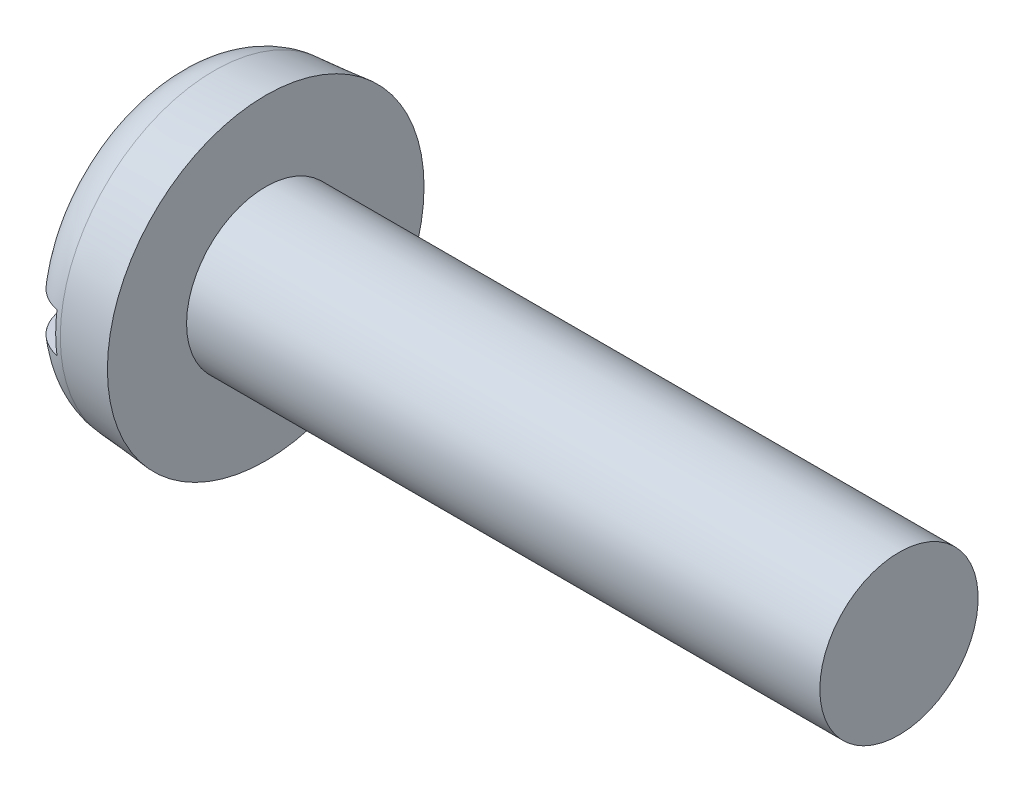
ISO-10303-21;
HEADER;
FILE_DESCRIPTION(('STEP AP214'),'2;1');
FILE_NAME('part.step','',(''),(''),'','','');
FILE_SCHEMA(('AUTOMOTIVE_DESIGN { 1 0 10303 214 1 1 1 1 }'));
ENDSEC;
DATA;
#1=APPLICATION_CONTEXT('core data for automotive mechanical design processes');
#2=APPLICATION_PROTOCOL_DEFINITION('international standard','automotive_design',2000,#1);
#3=PRODUCT_CONTEXT('',#1,'mechanical');
#4=PRODUCT('Part','Part','',(#3));
#5=PRODUCT_RELATED_PRODUCT_CATEGORY('part','',(#4));
#6=PRODUCT_DEFINITION_FORMATION('','',#4);
#7=PRODUCT_DEFINITION_CONTEXT('part definition',#1,'design');
#8=PRODUCT_DEFINITION('design','',#6,#7);
#9=PRODUCT_DEFINITION_SHAPE('','',#8);
#10=(LENGTH_UNIT() NAMED_UNIT(*) SI_UNIT(.MILLI.,.METRE.));
#11=(NAMED_UNIT(*) PLANE_ANGLE_UNIT() SI_UNIT($,.RADIAN.));
#12=(NAMED_UNIT(*) SI_UNIT($,.STERADIAN.) SOLID_ANGLE_UNIT());
#13=UNCERTAINTY_MEASURE_WITH_UNIT(LENGTH_MEASURE(1.E-05),#10,'distance_accuracy_value','');
#14=(GEOMETRIC_REPRESENTATION_CONTEXT(3) GLOBAL_UNCERTAINTY_ASSIGNED_CONTEXT((#13)) GLOBAL_UNIT_ASSIGNED_CONTEXT((#10,
#11,#12)) REPRESENTATION_CONTEXT('',''));
#15=CARTESIAN_POINT('',(0.,0.,0.));
#16=DIRECTION('',(0.,0.,1.));
#17=DIRECTION('',(1.,0.,0.));
#18=AXIS2_PLACEMENT_3D('',#15,#16,#17);
#19=CARTESIAN_POINT('',(0.,0.,0.));
#20=DIRECTION('',(-1.,0.,0.));
#21=DIRECTION('',(0.,0.,1.));
#22=AXIS2_PLACEMENT_3D('',#19,#20,#21);
#23=PLANE('',#22);
#24=DIRECTION('',(0.,0.,-1.));
#25=VECTOR('',#24,1.);
#26=CARTESIAN_POINT('',(0.,1.25,10.));
#27=LINE('',#26,#25);
#28=CARTESIAN_POINT('',(0.,1.25,6.60890143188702));
#29=VERTEX_POINT('',#28);
#30=CARTESIAN_POINT('',(0.,1.25,-6.60890143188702));
#31=VERTEX_POINT('',#30);
#32=EDGE_CURVE('E90',#29,#31,#27,.T.);
#33=ORIENTED_EDGE('',*,*,#32,.F.);
#34=CARTESIAN_POINT('',(0.,0.,0.));
#35=DIRECTION('',(-1.,0.,0.));
#36=DIRECTION('',(0.,0.,1.));
#37=AXIS2_PLACEMENT_3D('',#34,#35,#36);
#38=CIRCLE('',#37,6.72607449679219);
#39=EDGE_CURVE('E96',#29,#31,#38,.T.);
#40=ORIENTED_EDGE('',*,*,#39,.T.);
#41=EDGE_LOOP('',(#33,#40));
#42=FACE_BOUND('',#41,.T.);
#43=ADVANCED_FACE('F37',(#42),#23,.T.);
#44=CARTESIAN_POINT('',(-25.4,0.,0.));
#45=DIRECTION('',(-1.,0.,0.));
#46=DIRECTION('',(0.,0.,1.));
#47=AXIS2_PLACEMENT_3D('',#44,#45,#46);
#48=CYLINDRICAL_SURFACE('',#47,5.);
#49=CARTESIAN_POINT('',(46.,0.,0.));
#50=DIRECTION('',(-1.,0.,0.));
#51=DIRECTION('',(0.,0.,1.));
#52=AXIS2_PLACEMENT_3D('',#49,#50,#51);
#53=CIRCLE('',#52,5.);
#54=CARTESIAN_POINT('',(46.,0.,5.));
#55=VERTEX_POINT('',#54);
#56=EDGE_CURVE('E153',#55,#55,#53,.T.);
#57=ORIENTED_EDGE('',*,*,#56,.T.);
#58=EDGE_LOOP('',(#57));
#59=FACE_BOUND('',#58,.T.);
#60=CARTESIAN_POINT('',(6.,0.,0.));
#61=DIRECTION('',(-1.,0.,0.));
#62=DIRECTION('',(0.,0.,1.));
#63=AXIS2_PLACEMENT_3D('',#60,#61,#62);
#64=CIRCLE('',#63,5.);
#65=CARTESIAN_POINT('',(6.,0.,5.));
#66=VERTEX_POINT('',#65);
#67=EDGE_CURVE('E97',#66,#66,#64,.T.);
#68=ORIENTED_EDGE('',*,*,#67,.F.);
#69=EDGE_LOOP('',(#68));
#70=FACE_BOUND('',#69,.T.);
#71=ADVANCED_FACE('F142',(#59,#70),#48,.T.);
#72=CARTESIAN_POINT('',(6.,5.,0.));
#73=DIRECTION('',(-1.,0.,0.));
#74=DIRECTION('',(0.,0.,1.));
#75=AXIS2_PLACEMENT_3D('',#72,#73,#74);
#76=PLANE('',#75);
#77=CARTESIAN_POINT('',(6.,0.,0.));
#78=DIRECTION('',(-1.,0.,0.));
#79=DIRECTION('',(0.,0.,1.));
#80=AXIS2_PLACEMENT_3D('',#77,#78,#79);
#81=CIRCLE('',#80,10.);
#82=CARTESIAN_POINT('',(6.,0.,10.));
#83=VERTEX_POINT('',#82);
#84=EDGE_CURVE('E102',#83,#83,#81,.T.);
#85=ORIENTED_EDGE('',*,*,#84,.F.);
#86=EDGE_LOOP('',(#85));
#87=FACE_BOUND('',#86,.T.);
#88=ORIENTED_EDGE('',*,*,#67,.T.);
#89=EDGE_LOOP('',(#88));
#90=FACE_BOUND('',#89,.T.);
#91=ADVANCED_FACE('F139',(#87,#90),#76,.F.);
#92=CARTESIAN_POINT('',(0.,0.,0.));
#93=DIRECTION('',(1.,0.,0.));
#94=DIRECTION('',(0.,0.,-1.));
#95=AXIS2_PLACEMENT_3D('',#92,#93,#94);
#96=CONICAL_SURFACE('',#95,9.47506801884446,0.0872664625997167);
#97=CARTESIAN_POINT('',(2.73853277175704,0.,0.));
#98=DIRECTION('',(-1.,0.,0.));
#99=DIRECTION('',(0.,0.,1.));
#100=AXIS2_PLACEMENT_3D('',#97,#98,#99);
#101=CIRCLE('',#100,9.71465859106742);
#102=CARTESIAN_POINT('',(2.73853277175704,0.,9.71465859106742));
#103=VERTEX_POINT('',#102);
#104=EDGE_CURVE('E100',#103,#103,#101,.F.);
#105=ORIENTED_EDGE('',*,*,#104,.T.);
#106=EDGE_LOOP('',(#105));
#107=FACE_BOUND('',#106,.T.);
#108=ORIENTED_EDGE('',*,*,#84,.T.);
#109=EDGE_LOOP('',(#108));
#110=FACE_BOUND('',#109,.T.);
#111=ADVANCED_FACE('F136',(#107,#110),#96,.T.);
#112=DIRECTION('',(0.,0.,1.));
#113=VECTOR('',#112,1.);
#114=CARTESIAN_POINT('',(0.,-1.25,-10.));
#115=LINE('',#114,#113);
#116=CARTESIAN_POINT('',(0.,-1.25,-6.60890143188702));
#117=VERTEX_POINT('',#116);
#118=CARTESIAN_POINT('',(0.,-1.25,6.60890143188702));
#119=VERTEX_POINT('',#118);
#120=EDGE_CURVE('E81',#117,#119,#115,.T.);
#121=ORIENTED_EDGE('',*,*,#120,.F.);
#122=EDGE_CURVE('E88',#117,#119,#38,.T.);
#123=ORIENTED_EDGE('',*,*,#122,.T.);
#124=EDGE_LOOP('',(#121,#123));
#125=FACE_BOUND('',#124,.T.);
#126=ADVANCED_FACE('F87',(#125),#23,.T.);
#127=CARTESIAN_POINT('',(46.,5.,0.));
#128=DIRECTION('',(1.,0.,0.));
#129=DIRECTION('',(0.,0.,-1.));
#130=AXIS2_PLACEMENT_3D('',#127,#128,#129);
#131=PLANE('',#130);
#132=ORIENTED_EDGE('',*,*,#56,.F.);
#133=EDGE_LOOP('',(#132));
#134=FACE_BOUND('',#133,.T.);
#135=ADVANCED_FACE('F129',(#134),#131,.T.);
#136=CARTESIAN_POINT('',(3.,0.,0.));
#137=DIRECTION('',(-1.,0.,0.));
#138=DIRECTION('',(0.,0.,1.));
#139=AXIS2_PLACEMENT_3D('',#136,#137,#138);
#140=TOROIDAL_SURFACE('',#139,6.72607449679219,3.);
#141=CARTESIAN_POINT('',(0.913950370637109,1.25,-8.79369083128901));
#142=CARTESIAN_POINT('',(1.03407751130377,1.25,-8.91107806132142));
#143=CARTESIAN_POINT('',(1.16414710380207,1.25,-9.0184570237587));
#144=CARTESIAN_POINT('',(1.44055548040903,1.25,-9.20996884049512));
#145=CARTESIAN_POINT('',(1.58691212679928,1.25,-9.29407581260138));
#146=CARTESIAN_POINT('',(1.89167269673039,1.25,-9.43645928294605));
#147=CARTESIAN_POINT('',(2.0500739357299,1.25,-9.49474151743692));
#148=CARTESIAN_POINT('',(2.37439631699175,1.25,-9.58375548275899));
#149=CARTESIAN_POINT('',(2.54031567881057,1.25,-9.61449370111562));
#150=CARTESIAN_POINT('',(2.87435662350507,1.25,-9.64747712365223));
#151=CARTESIAN_POINT('',(3.04246808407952,1.25,-9.64982487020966));
#152=CARTESIAN_POINT('',(3.37669612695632,1.25,-9.62622242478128));
#153=CARTESIAN_POINT('',(3.54281266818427,1.25,-9.60027165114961));
#154=CARTESIAN_POINT('',(3.8681098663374,1.25,-9.52088746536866));
#155=CARTESIAN_POINT('',(4.02729932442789,1.25,-9.46749010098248));
#156=CARTESIAN_POINT('',(4.33448631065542,1.25,-9.33479520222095));
#157=CARTESIAN_POINT('',(4.48248380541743,1.25,-9.25549759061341));
#158=CARTESIAN_POINT('',(4.76352766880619,1.25,-9.07306642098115));
#159=CARTESIAN_POINT('',(4.89653363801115,1.25,-8.96987064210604));
#160=CARTESIAN_POINT('',(5.14347241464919,1.25,-8.74274923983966));
#161=CARTESIAN_POINT('',(5.25740480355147,1.25,-8.61882316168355));
#162=CARTESIAN_POINT('',(5.46381187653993,1.25,-8.35290133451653));
#163=CARTESIAN_POINT('',(5.5561381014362,1.25,-8.21079038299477));
#164=CARTESIAN_POINT('',(5.71591382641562,1.25,-7.91321813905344));
#165=CARTESIAN_POINT('',(5.78336219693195,1.25,-7.75775624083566));
#166=CARTESIAN_POINT('',(5.89229296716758,1.25,-7.43609765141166));
#167=CARTESIAN_POINT('',(5.93348408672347,1.25,-7.26980235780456));
#168=CARTESIAN_POINT('',(5.98780094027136,1.25,-6.93269546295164));
#169=CARTESIAN_POINT('',(6.00092472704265,1.25,-6.76188354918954));
#170=CARTESIAN_POINT('',(5.99895954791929,1.25,-6.41790932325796));
#171=CARTESIAN_POINT('',(5.98345242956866,1.25,-6.24474942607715));
#172=CARTESIAN_POINT('',(5.9240547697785,1.25,-5.90336911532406));
#173=CARTESIAN_POINT('',(5.88016160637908,1.25,-5.73514915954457));
#174=CARTESIAN_POINT('',(5.76444528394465,1.25,-5.40563318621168));
#175=CARTESIAN_POINT('',(5.69219500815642,1.25,-5.24448707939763));
#176=CARTESIAN_POINT('',(5.52187152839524,1.25,-4.93645275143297));
#177=CARTESIAN_POINT('',(5.42379531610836,1.25,-4.78956619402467));
#178=CARTESIAN_POINT('',(5.20362037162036,1.25,-4.51322087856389));
#179=CARTESIAN_POINT('',(5.08134720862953,1.25,-4.38390089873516));
#180=CARTESIAN_POINT('',(4.81646755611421,1.25,-4.14804563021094));
#181=CARTESIAN_POINT('',(4.67386150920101,1.25,-4.04150984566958));
#182=CARTESIAN_POINT('',(4.37493583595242,1.25,-3.85675206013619));
#183=CARTESIAN_POINT('',(4.21891607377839,1.25,-3.7780461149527));
#184=CARTESIAN_POINT('',(3.89540554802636,1.25,-3.64953247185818));
#185=CARTESIAN_POINT('',(3.72792001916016,1.25,-3.59971168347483));
#186=CARTESIAN_POINT('',(3.39522326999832,1.25,-3.53305783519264));
#187=CARTESIAN_POINT('',(3.23031745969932,1.25,-3.51469914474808));
#188=CARTESIAN_POINT('',(2.89985413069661,1.25,-3.50709369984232));
#189=CARTESIAN_POINT('',(2.73429676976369,1.25,-3.51784028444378));
#190=CARTESIAN_POINT('',(2.41348778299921,1.25,-3.56699036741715));
#191=CARTESIAN_POINT('',(2.25807967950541,1.25,-3.60438488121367));
#192=CARTESIAN_POINT('',(1.95549755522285,1.25,-3.70411822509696));
#193=CARTESIAN_POINT('',(1.80832473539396,1.25,-3.76646068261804));
#194=CARTESIAN_POINT('',(1.52239485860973,1.25,-3.91558892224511));
#195=CARTESIAN_POINT('',(1.38392868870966,1.25,-4.00293114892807));
#196=CARTESIAN_POINT('',(1.12266061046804,1.25,-4.19852761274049));
#197=CARTESIAN_POINT('',(0.999862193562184,1.25,-4.30678649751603));
#198=CARTESIAN_POINT('',(0.766801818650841,1.25,-4.54725082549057));
#199=CARTESIAN_POINT('',(0.657519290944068,1.25,-4.68040649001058));
#200=CARTESIAN_POINT('',(0.462072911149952,1.25,-4.96272965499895));
#201=CARTESIAN_POINT('',(0.375912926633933,1.25,-5.11189982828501));
#202=CARTESIAN_POINT('',(0.226781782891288,1.25,-5.42688300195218));
#203=CARTESIAN_POINT('',(0.164574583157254,1.25,-5.59305850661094));
#204=CARTESIAN_POINT('',(0.0689385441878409,1.25,-5.93349549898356));
#205=CARTESIAN_POINT('',(0.0355092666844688,1.25,-6.10775686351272));
#206=CARTESIAN_POINT('',(-0.00141343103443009,1.25,-6.45940175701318));
#207=CARTESIAN_POINT('',(-0.00491262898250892,1.25,-6.636784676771));
#208=CARTESIAN_POINT('',(0.0183732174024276,1.25,-6.98960681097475));
#209=CARTESIAN_POINT('',(0.0451639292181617,1.25,-7.16504565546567));
#210=CARTESIAN_POINT('',(0.127908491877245,1.25,-7.50633395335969));
#211=CARTESIAN_POINT('',(0.183455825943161,1.25,-7.67228216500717));
#212=CARTESIAN_POINT('',(0.322041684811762,1.25,-7.99211018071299));
#213=CARTESIAN_POINT('',(0.405044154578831,1.25,-8.14600548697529));
#214=CARTESIAN_POINT('',(0.560173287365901,1.25,-8.38236701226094));
#215=CARTESIAN_POINT('',(0.624662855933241,1.25,-8.4699404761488));
#216=CARTESIAN_POINT('',(0.76269837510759,1.25,-8.63763545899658));
#217=CARTESIAN_POINT('',(0.836244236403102,1.25,-8.71775705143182));
#218=CARTESIAN_POINT('',(0.913950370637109,1.25,-8.79369083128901));
#219=B_SPLINE_CURVE_WITH_KNOTS('',3,(#141,#142,#143,#144,#145,#146,#147,#148,#149,#150,#151,
#152,#153,#154,#155,#156,#157,#158,#159,#160,#161,#162,#163,#164,#165,#166,#167,#168,#169,#170,
#171,#172,#173,#174,#175,#176,#177,#178,#179,#180,#181,#182,#183,#184,#185,#186,#187,#188,#189,
#190,#191,#192,#193,#194,#195,#196,#197,#198,#199,#200,#201,#202,#203,#204,#205,#206,#207,#208,
#209,#210,#211,#212,#213,#214,#215,#216,#217,#218),.UNSPECIFIED.,.T.,.F.,(4,2,2,2,2,2,2,2,2,2,2,
2,2,2,2,2,2,2,2,2,2,2,2,2,2,2,2,2,2,2,2,2,2,2,2,2,2,2,4),(0.,0.503484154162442,1.00752603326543,
1.51145589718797,2.01526703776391,2.51725793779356,3.01925915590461,3.52060273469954,
4.02194780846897,4.52461314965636,5.02728951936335,5.53332459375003,6.0393826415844,
6.55096110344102,7.0625750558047,7.58172027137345,8.10091344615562,8.62824690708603,
9.15564182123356,9.68698702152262,10.2183206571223,10.7398986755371,11.2612401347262,
11.7564997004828,12.2516459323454,12.7289772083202,13.2063779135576,13.6953635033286,
14.1844578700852,14.6988978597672,15.2134238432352,15.7432176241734,16.2730033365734,
16.8026867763,17.3324693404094,17.854959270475,18.3767657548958,18.7024556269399,
19.0281422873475),.UNSPECIFIED.);
#220=CARTESIAN_POINT('',(2.4,1.25,-9.58429232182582));
#221=VERTEX_POINT('',#220);
#222=EDGE_CURVE('E11',#31,#221,#219,.T.);
#223=ORIENTED_EDGE('',*,*,#222,.F.);
#224=ORIENTED_EDGE('',*,*,#39,.F.);
#225=CARTESIAN_POINT('',(1.42400410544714,1.25,3.98178611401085));
#226=CARTESIAN_POINT('',(1.5612667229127,1.25,3.89297012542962));
#227=CARTESIAN_POINT('',(1.70580035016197,1.25,3.81523437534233));
#228=CARTESIAN_POINT('',(2.00584163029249,1.25,3.68474127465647));
#229=CARTESIAN_POINT('',(2.16135542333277,1.25,3.63199802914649));
#230=CARTESIAN_POINT('',(2.47937427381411,1.25,3.55367301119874));
#231=CARTESIAN_POINT('',(2.64188954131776,1.25,3.52813240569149));
#232=CARTESIAN_POINT('',(2.96885435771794,1.25,3.50557748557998));
#233=CARTESIAN_POINT('',(3.13330332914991,1.25,3.50855486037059));
#234=CARTESIAN_POINT('',(3.45489323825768,1.25,3.54240853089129));
#235=CARTESIAN_POINT('',(3.61211260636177,1.25,3.57254854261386));
#236=CARTESIAN_POINT('',(3.91940624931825,1.25,3.65837971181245));
#237=CARTESIAN_POINT('',(4.06947936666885,1.25,3.71407499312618));
#238=CARTESIAN_POINT('',(4.36105131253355,1.25,3.84997531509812));
#239=CARTESIAN_POINT('',(4.50236952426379,1.25,3.93056672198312));
#240=CARTESIAN_POINT('',(4.77037282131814,1.25,4.1132046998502));
#241=CARTESIAN_POINT('',(4.89705478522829,1.25,4.21525583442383));
#242=CARTESIAN_POINT('',(5.13904911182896,1.25,4.44362846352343));
#243=CARTESIAN_POINT('',(5.25343578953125,1.25,4.57093155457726));
#244=CARTESIAN_POINT('',(5.46008362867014,1.25,4.84238649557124));
#245=CARTESIAN_POINT('',(5.55234077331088,1.25,4.98654139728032));
#246=CARTESIAN_POINT('',(5.71512091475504,1.25,5.29301673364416));
#247=CARTESIAN_POINT('',(5.78479444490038,1.25,5.45578930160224));
#248=CARTESIAN_POINT('',(5.89593523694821,1.25,5.79070335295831));
#249=CARTESIAN_POINT('',(5.93740130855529,1.25,5.96284523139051));
#250=CARTESIAN_POINT('',(5.99085637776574,1.25,6.31223598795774));
#251=CARTESIAN_POINT('',(6.00274901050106,1.25,6.48949966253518));
#252=CARTESIAN_POINT('',(5.99618345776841,1.25,6.84347053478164));
#253=CARTESIAN_POINT('',(5.97772699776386,1.25,7.02017776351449));
#254=CARTESIAN_POINT('',(5.91120016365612,1.25,7.3655056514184));
#255=CARTESIAN_POINT('',(5.86352491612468,1.25,7.53420237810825));
#256=CARTESIAN_POINT('',(5.74006872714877,1.25,7.86098193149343));
#257=CARTESIAN_POINT('',(5.66429014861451,1.25,8.01906564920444));
#258=CARTESIAN_POINT('',(5.48810579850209,1.25,8.31744548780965));
#259=CARTESIAN_POINT('',(5.38811325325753,1.25,8.4579856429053));
#260=CARTESIAN_POINT('',(5.16566608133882,1.25,8.71999862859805));
#261=CARTESIAN_POINT('',(5.04321309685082,1.25,8.84147285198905));
#262=CARTESIAN_POINT('',(4.78105062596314,1.25,9.06026678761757));
#263=CARTESIAN_POINT('',(4.6415850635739,1.25,9.1578788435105));
#264=CARTESIAN_POINT('',(4.34813222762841,1.25,9.32806433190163));
#265=CARTESIAN_POINT('',(4.19414569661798,1.25,9.40063904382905));
#266=CARTESIAN_POINT('',(3.87745295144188,1.25,9.5180728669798));
#267=CARTESIAN_POINT('',(3.71483300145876,1.25,9.56316469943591));
#268=CARTESIAN_POINT('',(3.38431824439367,1.25,9.6252741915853));
#269=CARTESIAN_POINT('',(3.21642359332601,1.25,9.64229268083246));
#270=CARTESIAN_POINT('',(2.88090253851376,1.25,9.64774078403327));
#271=CARTESIAN_POINT('',(2.71327812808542,1.25,9.63629403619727));
#272=CARTESIAN_POINT('',(2.38233537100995,1.25,9.58540890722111));
#273=CARTESIAN_POINT('',(2.21901698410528,1.25,9.54597078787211));
#274=CARTESIAN_POINT('',(1.90136639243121,1.25,9.440278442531));
#275=CARTESIAN_POINT('',(1.74703114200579,1.25,9.37403336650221));
#276=CARTESIAN_POINT('',(1.45161989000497,1.25,9.21666160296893));
#277=CARTESIAN_POINT('',(1.31054399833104,1.25,9.12553470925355));
#278=CARTESIAN_POINT('',(1.04508569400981,1.25,8.92067026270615));
#279=CARTESIAN_POINT('',(0.920765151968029,1.25,8.80685255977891));
#280=CARTESIAN_POINT('',(0.69282275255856,1.25,8.56010291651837));
#281=CARTESIAN_POINT('',(0.58920150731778,1.25,8.42717041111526));
#282=CARTESIAN_POINT('',(0.404709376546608,1.25,8.14489607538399));
#283=CARTESIAN_POINT('',(0.324019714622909,1.25,7.99543583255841));
#284=CARTESIAN_POINT('',(0.188546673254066,1.25,7.68520850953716));
#285=CARTESIAN_POINT('',(0.133764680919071,1.25,7.52444082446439));
#286=CARTESIAN_POINT('',(0.0509263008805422,1.25,7.19412294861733));
#287=CARTESIAN_POINT('',(0.0231968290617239,1.25,7.02449081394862));
#288=CARTESIAN_POINT('',(-0.00385005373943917,1.25,6.68298800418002));
#289=CARTESIAN_POINT('',(-0.00316643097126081,1.25,6.51111724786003));
#290=CARTESIAN_POINT('',(0.02659266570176,1.25,6.16720755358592));
#291=CARTESIAN_POINT('',(0.0561017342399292,1.25,5.99520616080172));
#292=CARTESIAN_POINT('',(0.143149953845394,1.25,5.65840060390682));
#293=CARTESIAN_POINT('',(0.200698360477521,1.25,5.49359883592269));
#294=CARTESIAN_POINT('',(0.343213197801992,1.25,5.17328528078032));
#295=CARTESIAN_POINT('',(0.428585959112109,1.25,5.01795437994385));
#296=CARTESIAN_POINT('',(0.624063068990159,1.25,4.72386676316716));
#297=CARTESIAN_POINT('',(0.734143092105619,1.25,4.58509394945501));
#298=CARTESIAN_POINT('',(0.939954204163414,1.25,4.36648585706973));
#299=CARTESIAN_POINT('',(1.03018849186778,1.25,4.28140949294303));
#300=CARTESIAN_POINT('',(1.2202259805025,1.25,4.12269833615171));
#301=CARTESIAN_POINT('',(1.32002902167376,1.25,4.04906335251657));
#302=CARTESIAN_POINT('',(1.42400410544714,1.25,3.98178611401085));
#303=B_SPLINE_CURVE_WITH_KNOTS('',3,(#225,#226,#227,#228,#229,#230,#231,#232,#233,#234,#235,
#236,#237,#238,#239,#240,#241,#242,#243,#244,#245,#246,#247,#248,#249,#250,#251,#252,#253,#254,
#255,#256,#257,#258,#259,#260,#261,#262,#263,#264,#265,#266,#267,#268,#269,#270,#271,#272,#273,
#274,#275,#276,#277,#278,#279,#280,#281,#282,#283,#284,#285,#286,#287,#288,#289,#290,#291,#292,
#293,#294,#295,#296,#297,#298,#299,#300,#301,#302),.UNSPECIFIED.,.T.,.F.,(4,2,2,2,2,2,2,2,2,2,2,
2,2,2,2,2,2,2,2,2,2,2,2,2,2,2,2,2,2,2,2,2,2,2,2,2,2,2,4),(0.,0.490052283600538,
0.980380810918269,1.47145032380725,1.96237673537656,2.44038333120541,2.91846708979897,
3.40437848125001,3.89039331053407,4.40152059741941,4.91274059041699,5.44141242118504,
5.97010655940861,6.50052119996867,7.03090568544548,7.55427135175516,8.07759302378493,
8.59254557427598,9.10746048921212,9.61570935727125,10.1239322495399,10.6277895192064,
11.1316318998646,11.633289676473,12.1349427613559,12.6364247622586,13.1379109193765,
13.6412008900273,14.1445057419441,14.6516840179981,15.1588894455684,15.6721509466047,
16.1854311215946,16.7065528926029,17.2278467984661,17.7571227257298,18.2858798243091,
18.657095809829,19.0283055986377),.UNSPECIFIED.);
#304=CARTESIAN_POINT('',(2.4,1.25,9.58429232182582));
#305=VERTEX_POINT('',#304);
#306=EDGE_CURVE('E114',#305,#29,#303,.T.);
#307=ORIENTED_EDGE('',*,*,#306,.F.);
#308=CARTESIAN_POINT('',(2.4,0.,0.));
#309=DIRECTION('',(-1.,0.,0.));
#310=DIRECTION('',(0.,0.,1.));
#311=AXIS2_PLACEMENT_3D('',#308,#309,#310);
#312=CIRCLE('',#311,9.665462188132);
#313=CARTESIAN_POINT('',(2.4,-1.25,9.58429232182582));
#314=VERTEX_POINT('',#313);
#315=EDGE_CURVE('E108',#305,#314,#312,.F.);
#316=ORIENTED_EDGE('',*,*,#315,.T.);
#317=CARTESIAN_POINT('',(1.42400410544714,-1.25,3.98178611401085));
#318=CARTESIAN_POINT('',(1.27725127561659,-1.25,4.07675719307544));
#319=CARTESIAN_POINT('',(1.13859909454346,-1.25,4.18453932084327));
#320=CARTESIAN_POINT('',(0.881278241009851,-1.25,4.42203149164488));
#321=CARTESIAN_POINT('',(0.762645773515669,-1.25,4.55178043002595));
#322=CARTESIAN_POINT('',(0.548773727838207,-1.25,4.82899748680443));
#323=CARTESIAN_POINT('',(0.453498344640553,-1.25,4.97643796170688));
#324=CARTESIAN_POINT('',(0.288693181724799,-1.25,5.28498247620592));
#325=CARTESIAN_POINT('',(0.219153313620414,-1.25,5.44608113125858));
#326=CARTESIAN_POINT('',(0.106971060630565,-1.25,5.7798739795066));
#327=CARTESIAN_POINT('',(0.0647116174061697,-1.25,5.95269714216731));
#328=CARTESIAN_POINT('',(0.0100221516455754,-1.25,6.30302303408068));
#329=CARTESIAN_POINT('',(-0.00240602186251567,-1.25,6.48052605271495));
#330=CARTESIAN_POINT('',(0.00315593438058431,-1.25,6.83381450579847));
#331=CARTESIAN_POINT('',(0.0209325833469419,-1.25,7.00960323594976));
#332=CARTESIAN_POINT('',(0.0862335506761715,-1.25,7.35556997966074));
#333=CARTESIAN_POINT('',(0.133755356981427,-1.25,7.525748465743));
#334=CARTESIAN_POINT('',(0.25639134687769,-1.25,7.8527951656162));
#335=CARTESIAN_POINT('',(0.331058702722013,-1.25,8.00983092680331));
#336=CARTESIAN_POINT('',(0.506081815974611,-1.25,8.30887056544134));
#337=CARTESIAN_POINT('',(0.606435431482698,-1.25,8.45087569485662));
#338=CARTESIAN_POINT('',(0.828351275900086,-1.25,8.71360142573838));
#339=CARTESIAN_POINT('',(0.949576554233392,-1.25,8.83460669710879));
#340=CARTESIAN_POINT('',(1.21081660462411,-1.25,9.054274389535));
#341=CARTESIAN_POINT('',(1.35083022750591,-1.25,9.15293817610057));
#342=CARTESIAN_POINT('',(1.64402340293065,-1.25,9.32402645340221));
#343=CARTESIAN_POINT('',(1.79704381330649,-1.25,9.39672374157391));
#344=CARTESIAN_POINT('',(2.11317116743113,-1.25,9.51520554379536));
#345=CARTESIAN_POINT('',(2.27627769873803,-1.25,9.56099115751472));
#346=CARTESIAN_POINT('',(2.60681252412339,-1.25,9.6240827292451));
#347=CARTESIAN_POINT('',(2.77420606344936,-1.25,9.64157088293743));
#348=CARTESIAN_POINT('',(3.10954711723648,-1.25,9.64812292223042));
#349=CARTESIAN_POINT('',(3.27749462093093,-1.25,9.637187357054));
#350=CARTESIAN_POINT('',(3.60876227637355,-1.25,9.58727457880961));
#351=CARTESIAN_POINT('',(3.77209238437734,-1.25,9.54836339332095));
#352=CARTESIAN_POINT('',(4.0899162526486,-1.25,9.44371397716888));
#353=CARTESIAN_POINT('',(4.24441001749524,-1.25,9.37797576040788));
#354=CARTESIAN_POINT('',(4.5404588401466,-1.25,9.22146553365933));
#355=CARTESIAN_POINT('',(4.68199303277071,-1.25,9.13065406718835));
#356=CARTESIAN_POINT('',(4.94791239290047,-1.25,8.92668118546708));
#357=CARTESIAN_POINT('',(5.07229724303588,-1.25,8.81351935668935));
#358=CARTESIAN_POINT('',(5.30116231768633,-1.25,8.56741311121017));
#359=CARTESIAN_POINT('',(5.4055275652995,-1.25,8.43436179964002));
#360=CARTESIAN_POINT('',(5.59068859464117,-1.25,8.15276815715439));
#361=CARTESIAN_POINT('',(5.67148346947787,-1.25,8.00422523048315));
#362=CARTESIAN_POINT('',(5.80809437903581,-1.25,7.69433085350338));
#363=CARTESIAN_POINT('',(5.86365839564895,-1.25,7.53286834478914));
#364=CARTESIAN_POINT('',(5.94729502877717,-1.25,7.20297962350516));
#365=CARTESIAN_POINT('',(5.97536591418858,-1.25,7.03455297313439));
#366=CARTESIAN_POINT('',(6.00366240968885,-1.25,6.69303316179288));
#367=CARTESIAN_POINT('',(6.00349747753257,-1.25,6.51990767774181));
#368=CARTESIAN_POINT('',(5.97458490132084,-1.25,6.17606321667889));
#369=CARTESIAN_POINT('',(5.94583479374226,-1.25,6.00534444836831));
#370=CARTESIAN_POINT('',(5.86004783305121,-1.25,5.66826012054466));
#371=CARTESIAN_POINT('',(5.80256656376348,-1.25,5.50200762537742));
#372=CARTESIAN_POINT('',(5.66082163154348,-1.25,5.18132875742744));
#373=CARTESIAN_POINT('',(5.57655497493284,-1.25,5.02690370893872));
#374=CARTESIAN_POINT('',(5.38247308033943,-1.25,4.73255054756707));
#375=CARTESIAN_POINT('',(5.27238473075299,-1.25,4.5928023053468));
#376=CARTESIAN_POINT('',(5.0301036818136,-1.25,4.33394617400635));
#377=CARTESIAN_POINT('',(4.89790962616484,-1.25,4.21483955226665));
#378=CARTESIAN_POINT('',(4.61627663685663,-1.25,4.00224187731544));
#379=CARTESIAN_POINT('',(4.46701558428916,-1.25,3.90851571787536));
#380=CARTESIAN_POINT('',(4.15433964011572,-1.25,3.7487749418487));
#381=CARTESIAN_POINT('',(3.99093056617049,-1.25,3.68274899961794));
#382=CARTESIAN_POINT('',(3.66220213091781,-1.25,3.58358623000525));
#383=CARTESIAN_POINT('',(3.49727931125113,-1.25,3.54913656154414));
#384=CARTESIAN_POINT('',(3.16391164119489,-1.25,3.50993553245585));
#385=CARTESIAN_POINT('',(2.99546709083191,-1.25,3.50518165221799));
#386=CARTESIAN_POINT('',(2.66816300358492,-1.25,3.52512294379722));
#387=CARTESIAN_POINT('',(2.50921866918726,-1.25,3.5484750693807));
#388=CARTESIAN_POINT('',(2.1975963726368,-1.25,3.62133535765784));
#389=CARTESIAN_POINT('',(2.0449113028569,-1.25,3.67081291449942));
#390=CARTESIAN_POINT('',(1.81492039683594,-1.25,3.7666537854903));
#391=CARTESIAN_POINT('',(1.73406893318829,-1.25,3.80476648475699));
#392=CARTESIAN_POINT('',(1.57610803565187,-1.25,3.88806663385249));
#393=CARTESIAN_POINT('',(1.49899834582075,-1.25,3.93325359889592));
#394=CARTESIAN_POINT('',(1.42400410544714,-1.25,3.98178611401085));
#395=B_SPLINE_CURVE_WITH_KNOTS('',3,(#317,#318,#319,#320,#321,#322,#323,#324,#325,#326,#327,
#328,#329,#330,#331,#332,#333,#334,#335,#336,#337,#338,#339,#340,#341,#342,#343,#344,#345,#346,
#347,#348,#349,#350,#351,#352,#353,#354,#355,#356,#357,#358,#359,#360,#361,#362,#363,#364,#365,
#366,#367,#368,#369,#370,#371,#372,#373,#374,#375,#376,#377,#378,#379,#380,#381,#382,#383,#384,
#385,#386,#387,#388,#389,#390,#391,#392,#393,#394),.UNSPECIFIED.,.T.,.F.,(4,2,2,2,2,2,2,2,2,2,2,
2,2,2,2,2,2,2,2,2,2,2,2,2,2,2,2,2,2,2,2,2,2,2,2,2,2,2,4),(0.,0.524069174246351,1.04907618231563,
1.57327328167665,2.09726467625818,2.62846011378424,3.15968847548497,3.68717783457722,
4.21462265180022,4.73375188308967,5.25283783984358,5.76421810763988,6.27556711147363,
6.78137400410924,7.28716022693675,7.78967675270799,8.29218356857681,8.79350825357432,
9.29483267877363,9.79695055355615,10.2990777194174,10.8040076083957,11.3089569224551,
11.8188445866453,12.3287643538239,12.8457376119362,13.3627554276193,13.8880301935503,
14.4133636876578,14.94452627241,15.4757214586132,16.0018132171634,16.5276896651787,
17.0305528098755,17.5333732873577,18.013090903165,18.4922477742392,18.7600781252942,
19.0278901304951),.UNSPECIFIED.);
#396=EDGE_CURVE('E95',#119,#314,#395,.T.);
#397=ORIENTED_EDGE('',*,*,#396,.F.);
#398=ORIENTED_EDGE('',*,*,#122,.F.);
#399=CARTESIAN_POINT('',(0.913950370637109,-1.25,-8.79369083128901));
#400=CARTESIAN_POINT('',(0.79210800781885,-1.25,-8.67460585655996));
#401=CARTESIAN_POINT('',(0.680316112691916,-1.25,-8.54504497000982));
#402=CARTESIAN_POINT('',(0.480067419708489,-1.25,-8.26882508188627));
#403=CARTESIAN_POINT('',(0.391641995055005,-1.25,-8.12214346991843));
#404=CARTESIAN_POINT('',(0.240686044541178,-1.25,-7.81619154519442));
#405=CARTESIAN_POINT('',(0.178129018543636,-1.25,-7.65693431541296));
#406=CARTESIAN_POINT('',(0.0803669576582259,-1.25,-7.33029737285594));
#407=CARTESIAN_POINT('',(0.0451550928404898,-1.25,-7.16291969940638));
#408=CARTESIAN_POINT('',(0.00258611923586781,-1.25,-6.8229389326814));
#409=CARTESIAN_POINT('',(-0.0044848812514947,-1.25,-6.6503000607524));
#410=CARTESIAN_POINT('',(0.0099761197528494,-1.25,-6.30622052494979));
#411=CARTESIAN_POINT('',(0.0315117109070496,-1.25,-6.13478001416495));
#412=CARTESIAN_POINT('',(0.102962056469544,-1.25,-5.79506095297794));
#413=CARTESIAN_POINT('',(0.153323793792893,-1.25,-5.62687639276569));
#414=CARTESIAN_POINT('',(0.281213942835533,-1.25,-5.30116605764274));
#415=CARTESIAN_POINT('',(0.358745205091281,-1.25,-5.14364140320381));
#416=CARTESIAN_POINT('',(0.539940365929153,-1.25,-4.84173125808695));
#417=CARTESIAN_POINT('',(0.643916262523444,-1.25,-4.69753282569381));
#418=CARTESIAN_POINT('',(0.87472909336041,-1.25,-4.42872178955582));
#419=CARTESIAN_POINT('',(1.00156786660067,-1.25,-4.30411076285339));
#420=CARTESIAN_POINT('',(1.27395739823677,-1.25,-4.07913796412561));
#421=CARTESIAN_POINT('',(1.4193931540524,-1.25,-3.97863724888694));
#422=CARTESIAN_POINT('',(1.72562266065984,-1.25,-3.80464237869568));
#423=CARTESIAN_POINT('',(1.88641172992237,-1.25,-3.73114002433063));
#424=CARTESIAN_POINT('',(2.21202201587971,-1.25,-3.61665234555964));
#425=CARTESIAN_POINT('',(2.37642863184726,-1.25,-3.57449018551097));
#426=CARTESIAN_POINT('',(2.71009270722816,-1.25,-3.52000714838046));
#427=CARTESIAN_POINT('',(2.87934814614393,-1.25,-3.50767401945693));
#428=CARTESIAN_POINT('',(3.20890035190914,-1.25,-3.51330262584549));
#429=CARTESIAN_POINT('',(3.36922441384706,-1.25,-3.52978963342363));
#430=CARTESIAN_POINT('',(3.68480899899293,-1.25,-3.58947417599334));
#431=CARTESIAN_POINT('',(3.84006927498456,-1.25,-3.6326730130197));
#432=CARTESIAN_POINT('',(4.14135724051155,-1.25,-3.74396700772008));
#433=CARTESIAN_POINT('',(4.28738453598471,-1.25,-3.81206322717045));
#434=CARTESIAN_POINT('',(4.56668164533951,-1.25,-3.97069487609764));
#435=CARTESIAN_POINT('',(4.69994881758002,-1.25,-4.06123493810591));
#436=CARTESIAN_POINT('',(4.95679363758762,-1.25,-4.26685011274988));
#437=CARTESIAN_POINT('',(5.07959092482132,-1.25,-4.38290006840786));
#438=CARTESIAN_POINT('',(5.30493997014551,-1.25,-4.63322745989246));
#439=CARTESIAN_POINT('',(5.40748756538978,-1.25,-4.76750863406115));
#440=CARTESIAN_POINT('',(5.59366085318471,-1.25,-5.05663627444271));
#441=CARTESIAN_POINT('',(5.67631915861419,-1.25,-5.21210682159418));
#442=CARTESIAN_POINT('',(5.81467598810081,-1.25,-5.53462223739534));
#443=CARTESIAN_POINT('',(5.87037241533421,-1.25,-5.7016680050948));
#444=CARTESIAN_POINT('',(5.95354424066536,-1.25,-6.04446969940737));
#445=CARTESIAN_POINT('',(5.98072576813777,-1.25,-6.22029713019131));
#446=CARTESIAN_POINT('',(6.00484460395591,-1.25,-6.57402140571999));
#447=CARTESIAN_POINT('',(6.00178308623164,-1.25,-6.75191816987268));
#448=CARTESIAN_POINT('',(5.96544964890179,-1.25,-7.1026892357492));
#449=CARTESIAN_POINT('',(5.93250012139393,-1.25,-7.27559686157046));
#450=CARTESIAN_POINT('',(5.83755669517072,-1.25,-7.61324983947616));
#451=CARTESIAN_POINT('',(5.77556521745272,-1.25,-7.77799587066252));
#452=CARTESIAN_POINT('',(5.62538756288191,-1.25,-8.09181782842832));
#453=CARTESIAN_POINT('',(5.53763971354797,-1.25,-8.24110353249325));
#454=CARTESIAN_POINT('',(5.3379902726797,-1.25,-8.52254424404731));
#455=CARTESIAN_POINT('',(5.22609051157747,-1.25,-8.65470054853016));
#456=CARTESIAN_POINT('',(4.98302054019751,-1.25,-8.89619706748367));
#457=CARTESIAN_POINT('',(4.8521409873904,-1.25,-9.0058298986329));
#458=CARTESIAN_POINT('',(4.57368157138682,-1.25,-9.20130833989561));
#459=CARTESIAN_POINT('',(4.42610262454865,-1.25,-9.28715525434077));
#460=CARTESIAN_POINT('',(4.11998467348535,-1.25,-9.43178407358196));
#461=CARTESIAN_POINT('',(3.9615657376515,-1.25,-9.4908201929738));
#462=CARTESIAN_POINT('',(3.63704088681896,-1.25,-9.58129312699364));
#463=CARTESIAN_POINT('',(3.47093555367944,-1.25,-9.61273202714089));
#464=CARTESIAN_POINT('',(3.13672613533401,-1.25,-9.64698870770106));
#465=CARTESIAN_POINT('',(2.96863804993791,-1.25,-9.64996282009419));
#466=CARTESIAN_POINT('',(2.63430914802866,-1.25,-9.62760456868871));
#467=CARTESIAN_POINT('',(2.46806879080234,-1.25,-9.60226531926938));
#468=CARTESIAN_POINT('',(2.14236298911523,-1.25,-9.52406247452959));
#469=CARTESIAN_POINT('',(1.98289192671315,-1.25,-9.47122220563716));
#470=CARTESIAN_POINT('',(1.6752016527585,-1.25,-9.33960757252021));
#471=CARTESIAN_POINT('',(1.52696872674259,-1.25,-9.26086546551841));
#472=CARTESIAN_POINT('',(1.3015926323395,-1.25,-9.11576211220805));
#473=CARTESIAN_POINT('',(1.21955219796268,-1.25,-9.05685576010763));
#474=CARTESIAN_POINT('',(1.06181593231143,-1.25,-8.9310883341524));
#475=CARTESIAN_POINT('',(0.986120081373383,-1.25,-8.86422728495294));
#476=CARTESIAN_POINT('',(0.913950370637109,-1.25,-8.79369083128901));
#477=B_SPLINE_CURVE_WITH_KNOTS('',3,(#399,#400,#401,#402,#403,#404,#405,#406,#407,#408,#409,
#410,#411,#412,#413,#414,#415,#416,#417,#418,#419,#420,#421,#422,#423,#424,#425,#426,#427,#428,
#429,#430,#431,#432,#433,#434,#435,#436,#437,#438,#439,#440,#441,#442,#443,#444,#445,#446,#447,
#448,#449,#450,#451,#452,#453,#454,#455,#456,#457,#458,#459,#460,#461,#462,#463,#464,#465,#466,
#467,#468,#469,#470,#471,#472,#473,#474,#475,#476),.UNSPECIFIED.,.T.,.F.,(4,2,2,2,2,2,2,2,2,2,2,
2,2,2,2,2,2,2,2,2,2,2,2,2,2,2,2,2,2,2,2,2,2,2,2,2,2,2,4),(0.,0.510743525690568,1.02216936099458,
1.53306997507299,2.04384294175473,2.55979587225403,3.07581355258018,3.60005824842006,
4.12435796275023,4.6551562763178,5.18599730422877,5.71370146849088,6.24124523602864,
6.74781079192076,7.25416824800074,7.73536780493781,8.21659081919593,8.69783435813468,
9.17917731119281,9.6838002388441,10.1885267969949,10.7143009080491,11.24011590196,
11.7712981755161,12.3024598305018,12.8279592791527,13.3534149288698,13.8704009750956,
14.3873478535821,14.8970819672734,15.4067881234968,15.9115549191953,16.4162835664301,
16.9182385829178,17.4203156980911,17.9219676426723,18.422997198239,18.7255219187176,
19.0280457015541),.UNSPECIFIED.);
#478=CARTESIAN_POINT('',(2.4,-1.25,-9.58429232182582));
#479=VERTEX_POINT('',#478);
#480=EDGE_CURVE('E49',#479,#117,#477,.T.);
#481=ORIENTED_EDGE('',*,*,#480,.F.);
#482=EDGE_CURVE('E61',#479,#221,#312,.F.);
#483=ORIENTED_EDGE('',*,*,#482,.T.);
#484=EDGE_LOOP('',(#223,#224,#307,#316,#397,#398,#481,#483));
#485=FACE_BOUND('',#484,.T.);
#486=ORIENTED_EDGE('',*,*,#104,.F.);
#487=EDGE_LOOP('',(#486));
#488=FACE_BOUND('',#487,.T.);
#489=ADVANCED_FACE('F39',(#485,#488),#140,.T.);
#490=CARTESIAN_POINT('',(2.4,1.25,10.));
#491=DIRECTION('',(0.,1.,0.));
#492=DIRECTION('',(0.,0.,1.));
#493=AXIS2_PLACEMENT_3D('',#490,#491,#492);
#494=PLANE('',#493);
#495=ORIENTED_EDGE('',*,*,#222,.T.);
#496=DIRECTION('',(0.,0.,-1.));
#497=VECTOR('',#496,1.);
#498=CARTESIAN_POINT('',(2.4,1.25,10.));
#499=LINE('',#498,#497);
#500=EDGE_CURVE('E89',#305,#221,#499,.T.);
#501=ORIENTED_EDGE('',*,*,#500,.F.);
#502=ORIENTED_EDGE('',*,*,#306,.T.);
#503=ORIENTED_EDGE('',*,*,#32,.T.);
#504=EDGE_LOOP('',(#495,#501,#502,#503));
#505=FACE_BOUND('',#504,.T.);
#506=ADVANCED_FACE('F121',(#505),#494,.F.);
#507=CARTESIAN_POINT('',(2.4,-1.25,-10.));
#508=DIRECTION('',(0.,-1.,0.));
#509=DIRECTION('',(0.,0.,-1.));
#510=AXIS2_PLACEMENT_3D('',#507,#508,#509);
#511=PLANE('',#510);
#512=ORIENTED_EDGE('',*,*,#480,.T.);
#513=ORIENTED_EDGE('',*,*,#120,.T.);
#514=ORIENTED_EDGE('',*,*,#396,.T.);
#515=DIRECTION('',(0.,0.,1.));
#516=VECTOR('',#515,1.);
#517=CARTESIAN_POINT('',(2.4,-1.25,-10.));
#518=LINE('',#517,#516);
#519=EDGE_CURVE('E56',#479,#314,#518,.T.);
#520=ORIENTED_EDGE('',*,*,#519,.F.);
#521=EDGE_LOOP('',(#512,#513,#514,#520));
#522=FACE_BOUND('',#521,.T.);
#523=ADVANCED_FACE('F80',(#522),#511,.F.);
#524=CARTESIAN_POINT('',(2.4,1.25,-10.));
#525=DIRECTION('',(-1.,0.,0.));
#526=DIRECTION('',(0.,0.,1.));
#527=AXIS2_PLACEMENT_3D('',#524,#525,#526);
#528=PLANE('',#527);
#529=ORIENTED_EDGE('',*,*,#519,.T.);
#530=ORIENTED_EDGE('',*,*,#315,.F.);
#531=ORIENTED_EDGE('',*,*,#500,.T.);
#532=ORIENTED_EDGE('',*,*,#482,.F.);
#533=EDGE_LOOP('',(#529,#530,#531,#532));
#534=FACE_BOUND('',#533,.T.);
#535=ADVANCED_FACE('F120',(#534),#528,.T.);
#536=CLOSED_SHELL('',(#43,#71,#91,#111,#126,#135,#489,#506,#523,#535));
#537=MANIFOLD_SOLID_BREP('B2',#536);
#538=ADVANCED_BREP_SHAPE_REPRESENTATION('',(#18,#537),#14);
#539=SHAPE_DEFINITION_REPRESENTATION(#9,#538);
ENDSEC;
END-ISO-10303-21;
